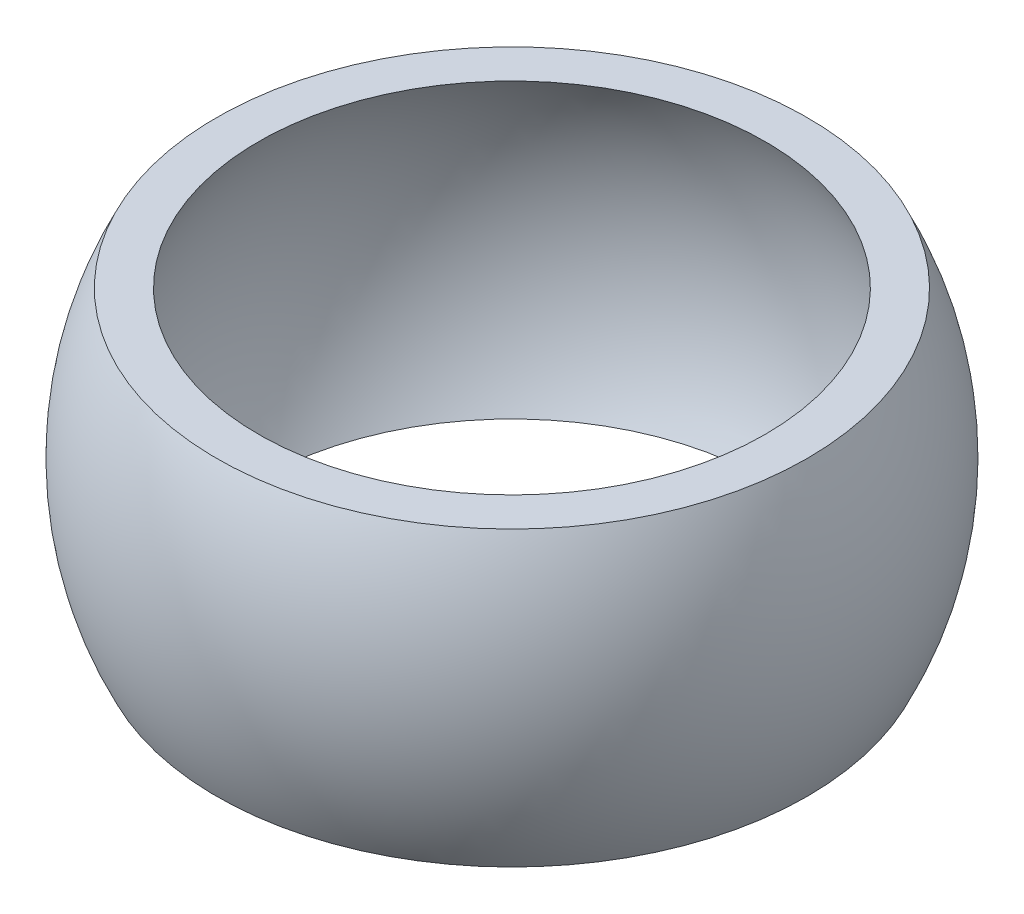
ISO-10303-21;
HEADER;
FILE_DESCRIPTION(('STEP AP214'),'2;1');
FILE_NAME('part.step','',(''),(''),'','','');
FILE_SCHEMA(('AUTOMOTIVE_DESIGN { 1 0 10303 214 1 1 1 1 }'));
ENDSEC;
DATA;
#1=APPLICATION_CONTEXT('core data for automotive mechanical design processes');
#2=APPLICATION_PROTOCOL_DEFINITION('international standard','automotive_design',2000,#1);
#3=PRODUCT_CONTEXT('',#1,'mechanical');
#4=PRODUCT('Part','Part','',(#3));
#5=PRODUCT_RELATED_PRODUCT_CATEGORY('part','',(#4));
#6=PRODUCT_DEFINITION_FORMATION('','',#4);
#7=PRODUCT_DEFINITION_CONTEXT('part definition',#1,'design');
#8=PRODUCT_DEFINITION('design','',#6,#7);
#9=PRODUCT_DEFINITION_SHAPE('','',#8);
#10=(LENGTH_UNIT() NAMED_UNIT(*) SI_UNIT(.MILLI.,.METRE.));
#11=(NAMED_UNIT(*) PLANE_ANGLE_UNIT() SI_UNIT($,.RADIAN.));
#12=(NAMED_UNIT(*) SI_UNIT($,.STERADIAN.) SOLID_ANGLE_UNIT());
#13=UNCERTAINTY_MEASURE_WITH_UNIT(LENGTH_MEASURE(1.E-05),#10,'distance_accuracy_value','');
#14=(GEOMETRIC_REPRESENTATION_CONTEXT(3) GLOBAL_UNCERTAINTY_ASSIGNED_CONTEXT((#13)) GLOBAL_UNIT_ASSIGNED_CONTEXT((#10,
#11,#12)) REPRESENTATION_CONTEXT('',''));
#15=CARTESIAN_POINT('',(0.,0.,0.));
#16=DIRECTION('',(0.,0.,1.));
#17=DIRECTION('',(1.,0.,0.));
#18=AXIS2_PLACEMENT_3D('',#15,#16,#17);
#19=CARTESIAN_POINT('',(0.,0.,0.));
#20=DIRECTION('',(0.,-1.,0.));
#21=DIRECTION('',(1.,0.,0.));
#22=AXIS2_PLACEMENT_3D('',#19,#20,#21);
#23=SPHERICAL_SURFACE('',#22,14.);
#24=CARTESIAN_POINT('',(0.,-7.,0.));
#25=DIRECTION('',(0.,-1.,0.));
#26=DIRECTION('',(0.,0.,-1.));
#27=AXIS2_PLACEMENT_3D('',#24,#25,#26);
#28=CIRCLE('',#27,12.1243556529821);
#29=CARTESIAN_POINT('',(12.1243556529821,-7.,0.));
#30=VERTEX_POINT('',#29);
#31=EDGE_CURVE('E44',#30,#30,#28,.T.);
#32=CARTESIAN_POINT('',(0.,7.,0.));
#33=DIRECTION('',(0.,-1.,0.));
#34=DIRECTION('',(0.,0.,-1.));
#35=AXIS2_PLACEMENT_3D('',#32,#33,#34);
#36=CIRCLE('',#35,12.1243556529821);
#37=CARTESIAN_POINT('',(12.1243556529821,7.,0.));
#38=VERTEX_POINT('',#37);
#39=EDGE_CURVE('E10',#38,#38,#36,.T.);
#40=CARTESIAN_POINT('',(12.1243556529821,-7.,0.));
#41=CARTESIAN_POINT('',(12.2007146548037,-6.86774425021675,0.));
#42=CARTESIAN_POINT('',(12.2749079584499,-6.73423819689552,0.));
#43=CARTESIAN_POINT('',(12.4188874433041,-6.46487043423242,0.));
#44=CARTESIAN_POINT('',(12.4886736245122,-6.32900872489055,0.));
#45=CARTESIAN_POINT('',(12.6237631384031,-6.05507460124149,0.));
#46=CARTESIAN_POINT('',(12.689066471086,-5.91700218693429,0.));
#47=CARTESIAN_POINT('',(12.8151206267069,-5.63879464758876,0.));
#48=CARTESIAN_POINT('',(12.875871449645,-5.49865952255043,0.));
#49=CARTESIAN_POINT('',(12.992755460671,-5.21647658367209,0.));
#50=CARTESIAN_POINT('',(13.0488886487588,-5.07442876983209,0.));
#51=CARTESIAN_POINT('',(13.1564773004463,-4.78857257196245,0.));
#52=CARTESIAN_POINT('',(13.207932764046,-4.64476418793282,0.));
#53=CARTESIAN_POINT('',(13.306110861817,-4.35554084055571,0.));
#54=CARTESIAN_POINT('',(13.3528334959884,-4.21012587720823,0.));
#55=CARTESIAN_POINT('',(13.4414959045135,-3.91784508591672,0.));
#56=CARTESIAN_POINT('',(13.4834356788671,-3.77097925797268,0.));
#57=CARTESIAN_POINT('',(13.5624874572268,-3.4759540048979,0.));
#58=CARTESIAN_POINT('',(13.5995994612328,-3.32779457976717,0.));
#59=CARTESIAN_POINT('',(13.6689559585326,-3.03034078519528,0.));
#60=CARTESIAN_POINT('',(13.7012004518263,-2.88104641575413,0.));
#61=CARTESIAN_POINT('',(13.7607873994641,-2.58148260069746,0.));
#62=CARTESIAN_POINT('',(13.7881298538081,-2.43121315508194,0.));
#63=CARTESIAN_POINT('',(13.8378834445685,-2.12986009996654,0.));
#64=CARTESIAN_POINT('',(13.8602945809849,-1.97877649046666,0.));
#65=CARTESIAN_POINT('',(13.9001615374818,-1.67595689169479,0.));
#66=CARTESIAN_POINT('',(13.9176173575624,-1.5242209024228,0.));
#67=CARTESIAN_POINT('',(13.9475549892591,-1.22025902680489,0.));
#68=CARTESIAN_POINT('',(13.9600368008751,-1.06803314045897,0.));
#69=CARTESIAN_POINT('',(13.9800130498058,-0.76325447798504,0.));
#70=CARTESIAN_POINT('',(13.9875074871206,-0.61070170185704,0.));
#71=CARTESIAN_POINT('',(13.9975009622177,-0.305432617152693,0.));
#72=CARTESIAN_POINT('',(14.,-0.152716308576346,0.));
#73=CARTESIAN_POINT('',(14.,0.152716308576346,0.));
#74=CARTESIAN_POINT('',(13.9975009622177,0.305432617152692,0.));
#75=CARTESIAN_POINT('',(13.9875074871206,0.610701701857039,0.));
#76=CARTESIAN_POINT('',(13.9800130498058,0.76325447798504,0.));
#77=CARTESIAN_POINT('',(13.9600368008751,1.06803314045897,0.));
#78=CARTESIAN_POINT('',(13.9475549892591,1.22025902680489,0.));
#79=CARTESIAN_POINT('',(13.9176173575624,1.5242209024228,0.));
#80=CARTESIAN_POINT('',(13.9001615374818,1.67595689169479,0.));
#81=CARTESIAN_POINT('',(13.8602945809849,1.97877649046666,0.));
#82=CARTESIAN_POINT('',(13.8378834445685,2.12986009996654,0.));
#83=CARTESIAN_POINT('',(13.7881298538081,2.43121315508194,0.));
#84=CARTESIAN_POINT('',(13.7607873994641,2.58148260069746,0.));
#85=CARTESIAN_POINT('',(13.7012004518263,2.88104641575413,0.));
#86=CARTESIAN_POINT('',(13.6689559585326,3.03034078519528,0.));
#87=CARTESIAN_POINT('',(13.5995994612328,3.32779457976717,0.));
#88=CARTESIAN_POINT('',(13.5624874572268,3.4759540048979,0.));
#89=CARTESIAN_POINT('',(13.4834356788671,3.77097925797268,0.));
#90=CARTESIAN_POINT('',(13.4414959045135,3.91784508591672,0.));
#91=CARTESIAN_POINT('',(13.3528334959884,4.21012587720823,0.));
#92=CARTESIAN_POINT('',(13.306110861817,4.35554084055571,0.));
#93=CARTESIAN_POINT('',(13.207932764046,4.64476418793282,0.));
#94=CARTESIAN_POINT('',(13.1564773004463,4.78857257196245,0.));
#95=CARTESIAN_POINT('',(13.0488886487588,5.07442876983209,0.));
#96=CARTESIAN_POINT('',(12.992755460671,5.21647658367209,0.));
#97=CARTESIAN_POINT('',(12.875871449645,5.49865952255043,0.));
#98=CARTESIAN_POINT('',(12.8151206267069,5.63879464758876,0.));
#99=CARTESIAN_POINT('',(12.689066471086,5.91700218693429,0.));
#100=CARTESIAN_POINT('',(12.6237631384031,6.05507460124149,0.));
#101=CARTESIAN_POINT('',(12.4886736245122,6.32900872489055,0.));
#102=CARTESIAN_POINT('',(12.4188874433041,6.46487043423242,0.));
#103=CARTESIAN_POINT('',(12.2749079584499,6.73423819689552,0.));
#104=CARTESIAN_POINT('',(12.2007146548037,6.86774425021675,0.));
#105=CARTESIAN_POINT('',(12.1243556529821,7.,0.));
#106=B_SPLINE_CURVE_WITH_KNOTS('',3,(#40,#41,#42,#43,#44,#45,#46,#47,#48,#49,#50,#51,#52,#53,
#54,#55,#56,#57,#58,#59,#60,#61,#62,#63,#64,#65,#66,#67,#68,#69,#70,#71,#72,#73,#74,#75,#76,#77,
#78,#79,#80,#81,#82,#83,#84,#85,#86,#87,#88,#89,#90,#91,#92,#93,#94,#95,#96,#97,#98,#99,#100,
#101,#102,#103,#104,#105),.UNSPECIFIED.,.F.,.F.,(4,2,2,2,2,2,2,2,2,2,2,2,2,2,2,2,2,2,2,2,2,2,2,
2,2,2,2,2,2,2,2,2,4),(0.,0.45812848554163,0.916256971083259,1.37438545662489,1.83251394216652,
2.29064242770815,2.74877091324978,3.20689939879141,3.66502788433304,4.12315636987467,
4.5812848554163,5.03941334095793,5.49754182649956,5.95567031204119,6.41379879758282,
6.87192728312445,7.33005576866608,7.78818425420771,8.24631273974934,8.70444122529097,
9.1625697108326,9.62069819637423,10.0788266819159,10.5369551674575,10.9950836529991,
11.4532121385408,11.9113406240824,12.369469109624,12.8275975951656,13.2857260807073,
13.7438545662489,14.2019830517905,14.6601115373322),.UNSPECIFIED.);
#107=EDGE_CURVE('BSEAM30',#30,#38,#106,.T.);
#108=ORIENTED_EDGE('',*,*,#31,.T.);
#109=ORIENTED_EDGE('',*,*,#39,.F.);
#110=ORIENTED_EDGE('',*,*,#107,.T.);
#111=ORIENTED_EDGE('',*,*,#107,.F.);
#112=EDGE_LOOP('',(#108,#110,#109,#111));
#113=FACE_BOUND('',#112,.T.);
#114=ADVANCED_FACE('F30',(#113),#23,.F.);
#115=CARTESIAN_POINT('',(12.1243556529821,7.,0.));
#116=DIRECTION('',(0.,1.,0.));
#117=DIRECTION('',(0.,0.,1.));
#118=AXIS2_PLACEMENT_3D('',#115,#116,#117);
#119=PLANE('',#118);
#120=ORIENTED_EDGE('',*,*,#39,.T.);
#121=EDGE_LOOP('',(#120));
#122=FACE_BOUND('',#121,.T.);
#123=CARTESIAN_POINT('',(0.,7.,0.));
#124=DIRECTION('',(0.,-1.,0.));
#125=DIRECTION('',(0.,0.,-1.));
#126=AXIS2_PLACEMENT_3D('',#123,#124,#125);
#127=CIRCLE('',#126,14.1243556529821);
#128=CARTESIAN_POINT('',(14.1243556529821,7.,0.));
#129=VERTEX_POINT('',#128);
#130=EDGE_CURVE('E36',#129,#129,#127,.T.);
#131=ORIENTED_EDGE('',*,*,#130,.F.);
#132=EDGE_LOOP('',(#131));
#133=FACE_BOUND('',#132,.T.);
#134=ADVANCED_FACE('F60',(#122,#133),#119,.T.);
#135=CARTESIAN_POINT('',(0.,0.,0.));
#136=DIRECTION('',(0.,-1.,0.));
#137=DIRECTION('',(1.,0.,0.));
#138=AXIS2_PLACEMENT_3D('',#135,#136,#137);
#139=SPHERICAL_SURFACE('',#138,15.7638010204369);
#140=CARTESIAN_POINT('',(0.,-7.,0.));
#141=DIRECTION('',(0.,-1.,0.));
#142=DIRECTION('',(0.,0.,-1.));
#143=AXIS2_PLACEMENT_3D('',#140,#141,#142);
#144=CIRCLE('',#143,14.1243556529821);
#145=CARTESIAN_POINT('',(14.1243556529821,-7.,0.));
#146=VERTEX_POINT('',#145);
#147=EDGE_CURVE('E40',#146,#146,#144,.T.);
#148=CARTESIAN_POINT('',(14.1243556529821,7.,0.));
#149=CARTESIAN_POINT('',(14.1914570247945,6.86460664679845,0.));
#150=CARTESIAN_POINT('',(14.2566104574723,6.72824793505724,0.));
#151=CARTESIAN_POINT('',(14.3829701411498,6.45371373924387,0.));
#152=CARTESIAN_POINT('',(14.4441763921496,6.31553825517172,0.));
#153=CARTESIAN_POINT('',(14.5625904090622,6.03748445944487,0.));
#154=CARTESIAN_POINT('',(14.6197981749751,5.89760614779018,0.));
#155=CARTESIAN_POINT('',(14.7301680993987,5.61626245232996,0.));
#156=CARTESIAN_POINT('',(14.7833302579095,5.47479706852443,0.));
#157=CARTESIAN_POINT('',(14.885564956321,5.19039618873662,0.));
#158=CARTESIAN_POINT('',(14.9346374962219,5.04746069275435,0.));
#159=CARTESIAN_POINT('',(15.0286523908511,4.76023779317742,0.));
#160=CARTESIAN_POINT('',(15.0735947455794,4.61595038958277,0.));
#161=CARTESIAN_POINT('',(15.1593121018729,4.32614298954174,0.));
#162=CARTESIAN_POINT('',(15.2000871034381,4.18062299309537,0.));
#163=CARTESIAN_POINT('',(15.2774360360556,3.88847074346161,0.));
#164=CARTESIAN_POINT('',(15.314009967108,3.74183849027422,0.));
#165=CARTESIAN_POINT('',(15.3829265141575,3.44758298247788,0.));
#166=CARTESIAN_POINT('',(15.4152691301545,3.29995972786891,0.));
#167=CARTESIAN_POINT('',(15.4756963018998,3.00384429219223,0.));
#168=CARTESIAN_POINT('',(15.5037808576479,2.8553521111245,0.));
#169=CARTESIAN_POINT('',(15.5556686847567,2.55762161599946,0.));
#170=CARTESIAN_POINT('',(15.5794719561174,2.40838330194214,0.));
#171=CARTESIAN_POINT('',(15.6227775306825,2.10928395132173,0.));
#172=CARTESIAN_POINT('',(15.642279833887,1.95942291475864,0.));
#173=CARTESIAN_POINT('',(15.6769673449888,1.65920204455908,0.));
#174=CARTESIAN_POINT('',(15.6921525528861,1.5088422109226,0.));
#175=CARTESIAN_POINT('',(15.7181933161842,1.20774808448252,0.));
#176=CARTESIAN_POINT('',(15.7290488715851,1.05701379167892,0.));
#177=CARTESIAN_POINT('',(15.7464213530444,0.755295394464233,0.));
#178=CARTESIAN_POINT('',(15.7529382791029,0.604311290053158,0.));
#179=CARTESIAN_POINT('',(15.7616281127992,0.302218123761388,0.));
#180=CARTESIAN_POINT('',(15.7638010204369,0.151109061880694,0.));
#181=CARTESIAN_POINT('',(15.7638010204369,-0.151109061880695,0.));
#182=CARTESIAN_POINT('',(15.7616281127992,-0.30221812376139,0.));
#183=CARTESIAN_POINT('',(15.7529382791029,-0.60431129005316,0.));
#184=CARTESIAN_POINT('',(15.7464213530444,-0.755295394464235,0.));
#185=CARTESIAN_POINT('',(15.7290488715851,-1.05701379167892,0.));
#186=CARTESIAN_POINT('',(15.7181933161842,-1.20774808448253,0.));
#187=CARTESIAN_POINT('',(15.6921525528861,-1.50884221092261,0.));
#188=CARTESIAN_POINT('',(15.6769673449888,-1.65920204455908,0.));
#189=CARTESIAN_POINT('',(15.642279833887,-1.95942291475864,0.));
#190=CARTESIAN_POINT('',(15.6227775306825,-2.10928395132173,0.));
#191=CARTESIAN_POINT('',(15.5794719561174,-2.40838330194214,0.));
#192=CARTESIAN_POINT('',(15.5556686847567,-2.55762161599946,0.));
#193=CARTESIAN_POINT('',(15.5037808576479,-2.85535211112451,0.));
#194=CARTESIAN_POINT('',(15.4756963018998,-3.00384429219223,0.));
#195=CARTESIAN_POINT('',(15.4152691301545,-3.29995972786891,0.));
#196=CARTESIAN_POINT('',(15.3829265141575,-3.44758298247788,0.));
#197=CARTESIAN_POINT('',(15.314009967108,-3.74183849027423,0.));
#198=CARTESIAN_POINT('',(15.2774360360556,-3.88847074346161,0.));
#199=CARTESIAN_POINT('',(15.2000871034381,-4.18062299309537,0.));
#200=CARTESIAN_POINT('',(15.1593121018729,-4.32614298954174,0.));
#201=CARTESIAN_POINT('',(15.0735947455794,-4.61595038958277,0.));
#202=CARTESIAN_POINT('',(15.0286523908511,-4.76023779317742,0.));
#203=CARTESIAN_POINT('',(14.9346374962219,-5.04746069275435,0.));
#204=CARTESIAN_POINT('',(14.885564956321,-5.19039618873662,0.));
#205=CARTESIAN_POINT('',(14.7833302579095,-5.47479706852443,0.));
#206=CARTESIAN_POINT('',(14.7301680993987,-5.61626245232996,0.));
#207=CARTESIAN_POINT('',(14.6197981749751,-5.89760614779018,0.));
#208=CARTESIAN_POINT('',(14.5625904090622,-6.03748445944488,0.));
#209=CARTESIAN_POINT('',(14.4441763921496,-6.31553825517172,0.));
#210=CARTESIAN_POINT('',(14.3829701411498,-6.45371373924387,0.));
#211=CARTESIAN_POINT('',(14.2566104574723,-6.72824793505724,0.));
#212=CARTESIAN_POINT('',(14.1914570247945,-6.86460664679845,0.));
#213=CARTESIAN_POINT('',(14.1243556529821,-7.,0.));
#214=B_SPLINE_CURVE_WITH_KNOTS('',3,(#148,#149,#150,#151,#152,#153,#154,#155,#156,#157,#158,
#159,#160,#161,#162,#163,#164,#165,#166,#167,#168,#169,#170,#171,#172,#173,#174,#175,#176,#177,
#178,#179,#180,#181,#182,#183,#184,#185,#186,#187,#188,#189,#190,#191,#192,#193,#194,#195,#196,
#197,#198,#199,#200,#201,#202,#203,#204,#205,#206,#207,#208,#209,#210,#211,#212,#213),
.UNSPECIFIED.,.F.,.F.,(4,2,2,2,2,2,2,2,2,2,2,2,2,2,2,2,2,2,2,2,2,2,2,2,2,2,2,2,2,2,2,2,4),(0.,
0.453311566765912,0.906623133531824,1.35993470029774,1.81324626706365,2.26655783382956,
2.71986940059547,3.17318096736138,3.6264925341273,4.07980410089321,4.53311566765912,
4.98642723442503,5.43973880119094,5.89305036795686,6.34636193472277,6.79967350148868,
7.25298506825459,7.7062966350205,8.15960820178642,8.61291976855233,9.06623133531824,
9.51954290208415,9.97285446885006,10.426166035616,10.8794776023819,11.3327891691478,
11.7861007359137,12.2394123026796,12.6927238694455,13.1460354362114,13.5993470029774,
14.0526585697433,14.5059701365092),.UNSPECIFIED.);
#215=EDGE_CURVE('BSEAM54',#129,#146,#214,.T.);
#216=ORIENTED_EDGE('',*,*,#130,.T.);
#217=ORIENTED_EDGE('',*,*,#147,.F.);
#218=ORIENTED_EDGE('',*,*,#215,.T.);
#219=ORIENTED_EDGE('',*,*,#215,.F.);
#220=EDGE_LOOP('',(#216,#218,#217,#219));
#221=FACE_BOUND('',#220,.T.);
#222=ADVANCED_FACE('F54',(#221),#139,.T.);
#223=CARTESIAN_POINT('',(12.1243556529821,-7.,0.));
#224=DIRECTION('',(0.,-1.,0.));
#225=DIRECTION('',(0.,0.,-1.));
#226=AXIS2_PLACEMENT_3D('',#223,#224,#225);
#227=PLANE('',#226);
#228=ORIENTED_EDGE('',*,*,#147,.T.);
#229=EDGE_LOOP('',(#228));
#230=FACE_BOUND('',#229,.T.);
#231=ORIENTED_EDGE('',*,*,#31,.F.);
#232=EDGE_LOOP('',(#231));
#233=FACE_BOUND('',#232,.T.);
#234=ADVANCED_FACE('F52',(#230,#233),#227,.T.);
#235=CLOSED_SHELL('',(#114,#134,#222,#234));
#236=MANIFOLD_SOLID_BREP('B2',#235);
#237=ADVANCED_BREP_SHAPE_REPRESENTATION('',(#18,#236),#14);
#238=SHAPE_DEFINITION_REPRESENTATION(#9,#237);
ENDSEC;
END-ISO-10303-21;
